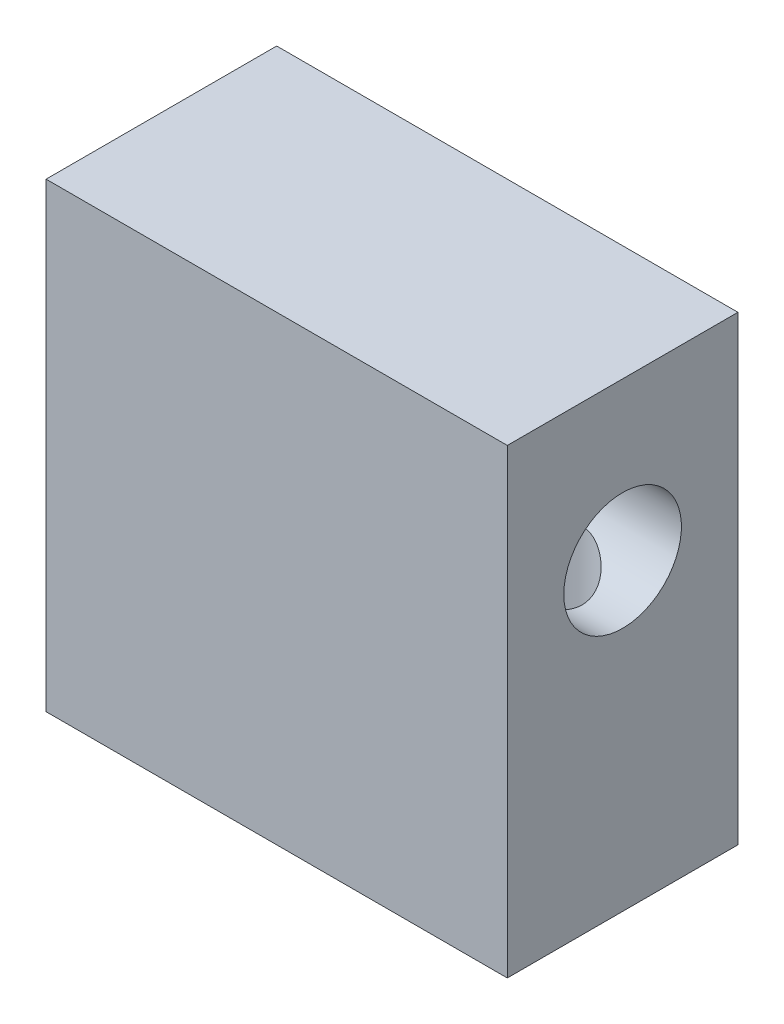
from build123d import *

# Parameters (mm, degrees)
SKETCH1_W          = 25.4
SKETCH1_H          = 25.4
BASE_EXTRUDE_DEPTH = 12.7
SKETCH4_R          = 3.2385
CUT_EXTRUDE1_DEPTH = 39.1
SKETCH5_R          = 2.54
CUT_EXTRUDE2_DEPTH = 19.05


with BuildPart() as part:
    # Sketch1 → Base-Extrude (new body)
    with BuildSketch(Plane.XY):
        with Locations((12.7, 12.7)):
            Rectangle(SKETCH1_W, SKETCH1_H)
    extrude(amount=BASE_EXTRUDE_DEPTH)

    # Sketch4 → Cut-Extrude1 (cut, through all)
    with BuildSketch(Plane.ZY):
        with Locations((6.35, 16.7386)):
            Circle(SKETCH4_R)
    extrude(amount=-CUT_EXTRUDE1_DEPTH, mode=Mode.SUBTRACT)

    # Sketch5 → Cut-Extrude2 (cut)
    with BuildSketch(Plane.XZ):
        with Locations((4.7498, 6.35)):
            Circle(SKETCH5_R)
        with Locations((20.6248, 6.35)):
            Circle(SKETCH5_R)
    extrude(amount=-CUT_EXTRUDE2_DEPTH, mode=Mode.SUBTRACT)


solid = part.part
